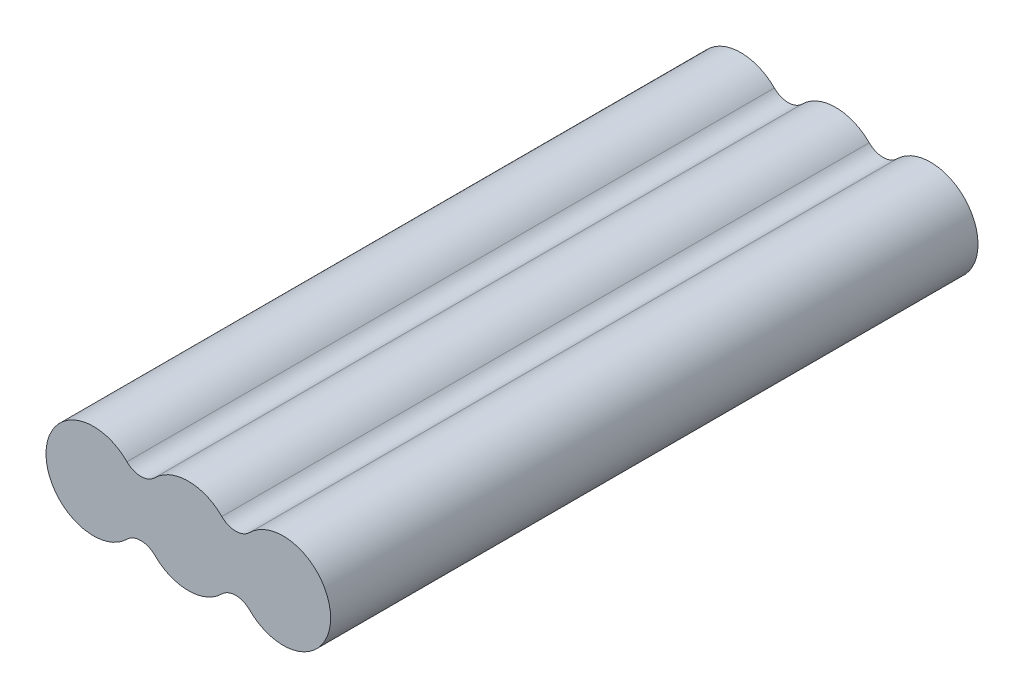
from build123d import *

# Parameters (mm, degrees)
BOSS_EXTRUDE1_DEPTH = 130


with BuildPart() as part:
    # Sketch1 → Boss-Extrude1 (new body)
    with BuildSketch(Plane.XY):
        with BuildLine():
            ThreePointArc((-6.735192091, -6.735192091), (0, -9.525), (6.735192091, -6.735192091))
            ThreePointArc((6.735192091, -6.735192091), (9.525, -5.579615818), (12.314807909, -6.735192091))
            ThreePointArc((12.314807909, -6.735192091), (28.575, 0), (12.314807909, 6.735192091))
            ThreePointArc((12.314807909, 6.735192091), (9.525, 5.579615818), (6.735192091, 6.735192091))
            ThreePointArc((6.735192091, 6.735192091), (0, 9.525), (-6.735192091, 6.735192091))
            ThreePointArc((-6.735192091, 6.735192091), (-9.525, 5.579615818), (-12.314807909, 6.735192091))
            ThreePointArc((-12.314807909, 6.735192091), (-28.575, 0), (-12.314807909, -6.735192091))
            ThreePointArc((-12.314807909, -6.735192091), (-9.525, -5.579615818), (-6.735192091, -6.735192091))
        make_face()
    extrude(amount=BOSS_EXTRUDE1_DEPTH)


solid = part.part
